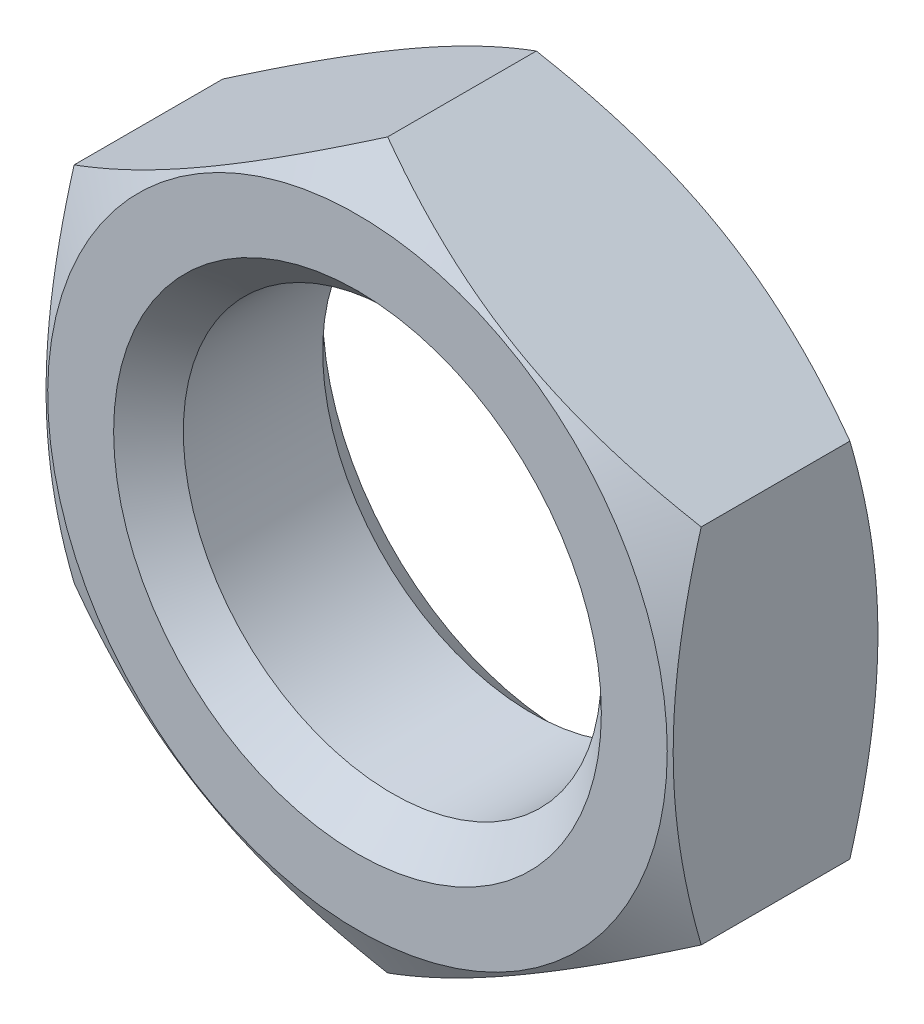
ISO-10303-21;
HEADER;
FILE_DESCRIPTION(('STEP AP214'),'2;1');
FILE_NAME('part.step','',(''),(''),'','','');
FILE_SCHEMA(('AUTOMOTIVE_DESIGN { 1 0 10303 214 1 1 1 1 }'));
ENDSEC;
DATA;
#1=APPLICATION_CONTEXT('core data for automotive mechanical design processes');
#2=APPLICATION_PROTOCOL_DEFINITION('international standard','automotive_design',2000,#1);
#3=PRODUCT_CONTEXT('',#1,'mechanical');
#4=PRODUCT('Part','Part','',(#3));
#5=PRODUCT_RELATED_PRODUCT_CATEGORY('part','',(#4));
#6=PRODUCT_DEFINITION_FORMATION('','',#4);
#7=PRODUCT_DEFINITION_CONTEXT('part definition',#1,'design');
#8=PRODUCT_DEFINITION('design','',#6,#7);
#9=PRODUCT_DEFINITION_SHAPE('','',#8);
#10=(LENGTH_UNIT() NAMED_UNIT(*) SI_UNIT(.MILLI.,.METRE.));
#11=(NAMED_UNIT(*) PLANE_ANGLE_UNIT() SI_UNIT($,.RADIAN.));
#12=(NAMED_UNIT(*) SI_UNIT($,.STERADIAN.) SOLID_ANGLE_UNIT());
#13=UNCERTAINTY_MEASURE_WITH_UNIT(LENGTH_MEASURE(1.E-05),#10,'distance_accuracy_value','');
#14=(GEOMETRIC_REPRESENTATION_CONTEXT(3) GLOBAL_UNCERTAINTY_ASSIGNED_CONTEXT((#13)) GLOBAL_UNIT_ASSIGNED_CONTEXT((#10,
#11,#12)) REPRESENTATION_CONTEXT('',''));
#15=CARTESIAN_POINT('',(0.,0.,0.));
#16=DIRECTION('',(0.,0.,1.));
#17=DIRECTION('',(1.,0.,0.));
#18=AXIS2_PLACEMENT_3D('',#15,#16,#17);
#19=CARTESIAN_POINT('',(13.5,7.79422863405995,4.5));
#20=DIRECTION('',(-0.5,-0.866025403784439,0.));
#21=DIRECTION('',(0.866025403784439,-0.5,0.));
#22=AXIS2_PLACEMENT_3D('',#19,#20,#21);
#23=PLANE('',#22);
#24=CARTESIAN_POINT('',(-0.000200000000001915,15.5885727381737,-3.20089522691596));
#25=CARTESIAN_POINT('',(0.296524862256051,15.417258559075,-3.29979725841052));
#26=CARTESIAN_POINT('',(0.59440711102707,15.2452761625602,-3.39421132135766));
#27=CARTESIAN_POINT('',(1.19256027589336,14.899932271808,-3.57281600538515));
#28=CARTESIAN_POINT('',(1.49283194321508,14.7265703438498,-3.65700326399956));
#29=CARTESIAN_POINT('',(2.09634426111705,14.3781323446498,-3.81402269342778));
#30=CARTESIAN_POINT('',(2.39959019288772,14.2030532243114,-3.88682799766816));
#31=CARTESIAN_POINT('',(3.00818925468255,13.8516783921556,-4.01952017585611));
#32=CARTESIAN_POINT('',(3.31354226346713,13.6753827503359,-4.07940778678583));
#33=CARTESIAN_POINT('',(3.91853115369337,13.3260922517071,-4.18371734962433));
#34=CARTESIAN_POINT('',(4.21812211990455,13.1531233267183,-4.22848454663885));
#35=CARTESIAN_POINT('',(4.81867684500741,12.8063928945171,-4.30354932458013));
#36=CARTESIAN_POINT('',(5.11964063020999,12.632631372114,-4.33384662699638));
#37=CARTESIAN_POINT('',(5.72207378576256,12.284816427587,-4.37920662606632));
#38=CARTESIAN_POINT('',(6.02354212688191,12.1107635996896,-4.3942874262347));
#39=CARTESIAN_POINT('',(6.62675710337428,11.7624972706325,-4.40889009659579));
#40=CARTESIAN_POINT('',(6.92850372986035,11.5882837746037,-4.40841244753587));
#41=CARTESIAN_POINT('',(7.49261810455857,11.2625921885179,-4.39298492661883));
#42=CARTESIAN_POINT('',(7.75502605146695,11.1110908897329,-4.37991684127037));
#43=CARTESIAN_POINT('',(8.27923834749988,10.8084367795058,-4.3422606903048));
#44=CARTESIAN_POINT('',(8.54104265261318,10.6572839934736,-4.31767180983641));
#45=CARTESIAN_POINT('',(9.06390546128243,10.3554090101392,-4.25740279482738));
#46=CARTESIAN_POINT('',(9.32496316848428,10.2046872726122,-4.22171349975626));
#47=CARTESIAN_POINT('',(9.84585469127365,9.90395041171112,-4.13986982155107));
#48=CARTESIAN_POINT('',(10.1056884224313,9.7539353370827,-4.09371472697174));
#49=CARTESIAN_POINT('',(10.8944281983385,9.29855621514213,-3.93838400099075));
#50=CARTESIAN_POINT('',(11.4210501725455,8.99451087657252,-3.81372022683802));
#51=CARTESIAN_POINT('',(12.4664415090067,8.39095390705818,-3.53078439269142));
#52=CARTESIAN_POINT('',(12.9852242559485,8.09143454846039,-3.37257878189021));
#53=CARTESIAN_POINT('',(13.5002,7.79411316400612,-3.20089522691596));
#54=B_SPLINE_CURVE_WITH_KNOTS('',3,(#24,#25,#26,#27,#28,#29,#30,#31,#32,#33,#34,#35,#36,#37,#38,
#39,#40,#41,#42,#43,#44,#45,#46,#47,#48,#49,#50,#51,#52,#53),.UNSPECIFIED.,.F.,.F.,(4,2,2,2,2,2,
2,2,2,2,2,2,2,2,4),(0.,1.0698794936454,2.14010980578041,3.21282939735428,4.28548777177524,
5.33167033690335,6.3778730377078,7.42282956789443,8.46775380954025,9.37738732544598,
10.2870851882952,11.1975357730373,12.1080482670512,13.9691139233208,15.8265265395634),.UNSPECIFIED.);
#55=CARTESIAN_POINT('',(0.,15.5884572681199,-3.20096189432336));
#56=VERTEX_POINT('',#55);
#57=CARTESIAN_POINT('',(13.5,7.79422863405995,-3.20096189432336));
#58=VERTEX_POINT('',#57);
#59=EDGE_CURVE('E55',#56,#58,#54,.T.);
#60=ORIENTED_EDGE('',*,*,#59,.F.);
#61=DIRECTION('',(0.,0.,-1.));
#62=VECTOR('',#61,1.);
#63=CARTESIAN_POINT('',(0.,15.5884572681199,4.5));
#64=LINE('',#63,#62);
#65=CARTESIAN_POINT('',(0.,15.5884572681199,3.20096189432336));
#66=VERTEX_POINT('',#65);
#67=EDGE_CURVE('E105',#66,#56,#64,.T.);
#68=ORIENTED_EDGE('',*,*,#67,.F.);
#69=CARTESIAN_POINT('',(13.5002,7.79411316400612,3.20089522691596));
#70=CARTESIAN_POINT('',(13.2034751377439,7.9654273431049,3.29979725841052));
#71=CARTESIAN_POINT('',(12.9055928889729,8.13740973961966,3.39421132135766));
#72=CARTESIAN_POINT('',(12.3074397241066,8.48275363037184,3.57281600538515));
#73=CARTESIAN_POINT('',(12.0071680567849,8.65611555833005,3.65700326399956));
#74=CARTESIAN_POINT('',(11.403655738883,9.00455355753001,3.81402269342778));
#75=CARTESIAN_POINT('',(11.1004098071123,9.17963267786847,3.88682799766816));
#76=CARTESIAN_POINT('',(10.4918107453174,9.53100751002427,4.01952017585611));
#77=CARTESIAN_POINT('',(10.1864577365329,9.70730315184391,4.07940778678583));
#78=CARTESIAN_POINT('',(9.58146884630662,10.0565936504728,4.18371734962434));
#79=CARTESIAN_POINT('',(9.28187788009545,10.2295625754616,4.22848454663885));
#80=CARTESIAN_POINT('',(8.68132315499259,10.5762930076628,4.30354932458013));
#81=CARTESIAN_POINT('',(8.38035936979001,10.7500545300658,4.33384662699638));
#82=CARTESIAN_POINT('',(7.77792621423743,11.0978694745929,4.37920662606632));
#83=CARTESIAN_POINT('',(7.47645787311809,11.2719223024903,4.3942874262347));
#84=CARTESIAN_POINT('',(6.87324289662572,11.6201886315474,4.4088900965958));
#85=CARTESIAN_POINT('',(6.57149627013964,11.7944021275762,4.40841244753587));
#86=CARTESIAN_POINT('',(6.00738189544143,12.1200937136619,4.39298492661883));
#87=CARTESIAN_POINT('',(5.74497394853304,12.271595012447,4.37991684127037));
#88=CARTESIAN_POINT('',(5.22076165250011,12.5742491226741,4.3422606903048));
#89=CARTESIAN_POINT('',(4.95895734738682,12.7254019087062,4.31767180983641));
#90=CARTESIAN_POINT('',(4.43609453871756,13.0272768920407,4.25740279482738));
#91=CARTESIAN_POINT('',(4.17503683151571,13.1779986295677,4.22171349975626));
#92=CARTESIAN_POINT('',(3.65414530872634,13.4787354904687,4.13986982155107));
#93=CARTESIAN_POINT('',(3.39431157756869,13.6287505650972,4.09371472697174));
#94=CARTESIAN_POINT('',(2.60557180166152,14.0841296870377,3.93838400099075));
#95=CARTESIAN_POINT('',(2.07894982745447,14.3881750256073,3.81372022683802));
#96=CARTESIAN_POINT('',(1.03355849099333,14.9917319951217,3.53078439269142));
#97=CARTESIAN_POINT('',(0.514775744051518,15.2912513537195,3.37257878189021));
#98=CARTESIAN_POINT('',(-0.000200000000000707,15.5885727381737,3.20089522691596));
#99=B_SPLINE_CURVE_WITH_KNOTS('',3,(#69,#70,#71,#72,#73,#74,#75,#76,#77,#78,#79,#80,#81,#82,#83,
#84,#85,#86,#87,#88,#89,#90,#91,#92,#93,#94,#95,#96,#97,#98),.UNSPECIFIED.,.F.,.F.,(4,2,2,2,2,2,
2,2,2,2,2,2,2,2,4),(0.,1.0698794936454,2.14010980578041,3.21282939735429,4.28548777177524,
5.33167033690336,6.37787303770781,7.42282956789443,8.46775380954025,9.37738732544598,
10.2870851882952,11.1975357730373,12.1080482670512,13.9691139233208,15.8265265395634),.UNSPECIFIED.);
#100=CARTESIAN_POINT('',(13.5,7.79422863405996,3.20096189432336));
#101=VERTEX_POINT('',#100);
#102=EDGE_CURVE('E219',#101,#66,#99,.T.);
#103=ORIENTED_EDGE('',*,*,#102,.F.);
#104=DIRECTION('',(0.,0.,-1.));
#105=VECTOR('',#104,1.);
#106=CARTESIAN_POINT('',(13.5,7.79422863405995,4.5));
#107=LINE('',#106,#105);
#108=EDGE_CURVE('E107',#101,#58,#107,.T.);
#109=ORIENTED_EDGE('',*,*,#108,.T.);
#110=EDGE_LOOP('',(#60,#68,#103,#109));
#111=FACE_BOUND('',#110,.T.);
#112=ADVANCED_FACE('F39',(#111),#23,.F.);
#113=CARTESIAN_POINT('',(0.,15.5884572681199,4.5));
#114=DIRECTION('',(0.5,-0.866025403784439,0.));
#115=DIRECTION('',(0.866025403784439,0.5,0.));
#116=AXIS2_PLACEMENT_3D('',#113,#114,#115);
#117=PLANE('',#116);
#118=CARTESIAN_POINT('',(-13.5002,7.79411316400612,-3.20089522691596));
#119=CARTESIAN_POINT('',(-13.2034751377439,7.96542734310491,-3.29979725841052));
#120=CARTESIAN_POINT('',(-12.9055928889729,8.13740973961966,-3.39421132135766));
#121=CARTESIAN_POINT('',(-12.3074397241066,8.48275363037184,-3.57281600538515));
#122=CARTESIAN_POINT('',(-12.0071680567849,8.65611555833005,-3.65700326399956));
#123=CARTESIAN_POINT('',(-11.403655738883,9.00455355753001,-3.81402269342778));
#124=CARTESIAN_POINT('',(-11.1004098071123,9.17963267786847,-3.88682799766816));
#125=CARTESIAN_POINT('',(-10.4918107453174,9.53100751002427,-4.01952017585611));
#126=CARTESIAN_POINT('',(-10.1864577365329,9.70730315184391,-4.07940778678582));
#127=CARTESIAN_POINT('',(-9.58146884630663,10.0565936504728,-4.18371734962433));
#128=CARTESIAN_POINT('',(-9.28187788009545,10.2295625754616,-4.22848454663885));
#129=CARTESIAN_POINT('',(-8.68132315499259,10.5762930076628,-4.30354932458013));
#130=CARTESIAN_POINT('',(-8.38035936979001,10.7500545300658,-4.33384662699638));
#131=CARTESIAN_POINT('',(-7.77792621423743,11.0978694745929,-4.37920662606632));
#132=CARTESIAN_POINT('',(-7.47645787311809,11.2719223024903,-4.3942874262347));
#133=CARTESIAN_POINT('',(-6.87324289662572,11.6201886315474,-4.40889009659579));
#134=CARTESIAN_POINT('',(-6.57149627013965,11.7944021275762,-4.40841244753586));
#135=CARTESIAN_POINT('',(-6.00738189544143,12.1200937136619,-4.39298492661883));
#136=CARTESIAN_POINT('',(-5.74497394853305,12.271595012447,-4.37991684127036));
#137=CARTESIAN_POINT('',(-5.22076165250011,12.5742491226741,-4.3422606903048));
#138=CARTESIAN_POINT('',(-4.95895734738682,12.7254019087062,-4.31767180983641));
#139=CARTESIAN_POINT('',(-4.43609453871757,13.0272768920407,-4.25740279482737));
#140=CARTESIAN_POINT('',(-4.17503683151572,13.1779986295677,-4.22171349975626));
#141=CARTESIAN_POINT('',(-3.65414530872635,13.4787354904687,-4.13986982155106));
#142=CARTESIAN_POINT('',(-3.39431157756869,13.6287505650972,-4.09371472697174));
#143=CARTESIAN_POINT('',(-2.60557180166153,14.0841296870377,-3.93838400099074));
#144=CARTESIAN_POINT('',(-2.07894982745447,14.3881750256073,-3.81372022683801));
#145=CARTESIAN_POINT('',(-1.03355849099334,14.9917319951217,-3.53078439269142));
#146=CARTESIAN_POINT('',(-0.514775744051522,15.2912513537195,-3.37257878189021));
#147=CARTESIAN_POINT('',(0.000199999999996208,15.5885727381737,-3.20089522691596));
#148=B_SPLINE_CURVE_WITH_KNOTS('',3,(#118,#119,#120,#121,#122,#123,#124,#125,#126,#127,#128,
#129,#130,#131,#132,#133,#134,#135,#136,#137,#138,#139,#140,#141,#142,#143,#144,#145,#146,#147),
.UNSPECIFIED.,.F.,.F.,(4,2,2,2,2,2,2,2,2,2,2,2,2,2,4),(0.,1.0698794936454,2.14010980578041,
3.21282939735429,4.28548777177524,5.33167033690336,6.37787303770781,7.42282956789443,
8.46775380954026,9.37738732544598,10.2870851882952,11.1975357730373,12.1080482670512,
13.9691139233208,15.8265265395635),.UNSPECIFIED.);
#149=CARTESIAN_POINT('',(-13.5,7.79422863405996,-3.20096189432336));
#150=VERTEX_POINT('',#149);
#151=EDGE_CURVE('E91',#150,#56,#148,.T.);
#152=ORIENTED_EDGE('',*,*,#151,.F.);
#153=DIRECTION('',(0.,0.,-1.));
#154=VECTOR('',#153,1.);
#155=CARTESIAN_POINT('',(-13.5,7.79422863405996,4.5));
#156=LINE('',#155,#154);
#157=CARTESIAN_POINT('',(-13.5,7.79422863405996,3.20096189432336));
#158=VERTEX_POINT('',#157);
#159=EDGE_CURVE('E116',#158,#150,#156,.T.);
#160=ORIENTED_EDGE('',*,*,#159,.F.);
#161=CARTESIAN_POINT('',(0.000199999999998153,15.5885727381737,3.20089522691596));
#162=CARTESIAN_POINT('',(-0.296524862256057,15.417258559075,3.29979725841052));
#163=CARTESIAN_POINT('',(-0.594407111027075,15.2452761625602,3.39421132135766));
#164=CARTESIAN_POINT('',(-1.19256027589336,14.899932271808,3.57281600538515));
#165=CARTESIAN_POINT('',(-1.49283194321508,14.7265703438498,3.65700326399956));
#166=CARTESIAN_POINT('',(-2.09634426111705,14.3781323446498,3.81402269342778));
#167=CARTESIAN_POINT('',(-2.39959019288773,14.2030532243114,3.88682799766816));
#168=CARTESIAN_POINT('',(-3.00818925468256,13.8516783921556,4.01952017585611));
#169=CARTESIAN_POINT('',(-3.31354226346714,13.6753827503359,4.07940778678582));
#170=CARTESIAN_POINT('',(-3.91853115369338,13.3260922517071,4.18371734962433));
#171=CARTESIAN_POINT('',(-4.21812211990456,13.1531233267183,4.22848454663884));
#172=CARTESIAN_POINT('',(-4.81867684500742,12.8063928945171,4.30354932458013));
#173=CARTESIAN_POINT('',(-5.11964063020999,12.632631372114,4.33384662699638));
#174=CARTESIAN_POINT('',(-5.72207378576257,12.284816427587,4.37920662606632));
#175=CARTESIAN_POINT('',(-6.02354212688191,12.1107635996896,4.3942874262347));
#176=CARTESIAN_POINT('',(-6.62675710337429,11.7624972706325,4.40889009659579));
#177=CARTESIAN_POINT('',(-6.92850372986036,11.5882837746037,4.40841244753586));
#178=CARTESIAN_POINT('',(-7.49261810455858,11.2625921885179,4.39298492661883));
#179=CARTESIAN_POINT('',(-7.75502605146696,11.1110908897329,4.37991684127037));
#180=CARTESIAN_POINT('',(-8.27923834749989,10.8084367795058,4.3422606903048));
#181=CARTESIAN_POINT('',(-8.54104265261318,10.6572839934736,4.31767180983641));
#182=CARTESIAN_POINT('',(-9.06390546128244,10.3554090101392,4.25740279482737));
#183=CARTESIAN_POINT('',(-9.32496316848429,10.2046872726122,4.22171349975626));
#184=CARTESIAN_POINT('',(-9.84585469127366,9.90395041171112,4.13986982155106));
#185=CARTESIAN_POINT('',(-10.1056884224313,9.7539353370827,4.09371472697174));
#186=CARTESIAN_POINT('',(-10.8944281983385,9.29855621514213,3.93838400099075));
#187=CARTESIAN_POINT('',(-11.4210501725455,8.99451087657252,3.81372022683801));
#188=CARTESIAN_POINT('',(-12.4664415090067,8.39095390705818,3.53078439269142));
#189=CARTESIAN_POINT('',(-12.9852242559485,8.09143454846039,3.37257878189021));
#190=CARTESIAN_POINT('',(-13.5002,7.79411316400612,3.20089522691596));
#191=B_SPLINE_CURVE_WITH_KNOTS('',3,(#161,#162,#163,#164,#165,#166,#167,#168,#169,#170,#171,
#172,#173,#174,#175,#176,#177,#178,#179,#180,#181,#182,#183,#184,#185,#186,#187,#188,#189,#190),
.UNSPECIFIED.,.F.,.F.,(4,2,2,2,2,2,2,2,2,2,2,2,2,2,4),(0.,1.0698794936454,2.14010980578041,
3.21282939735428,4.28548777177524,5.33167033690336,6.37787303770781,7.42282956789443,
8.46775380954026,9.37738732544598,10.2870851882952,11.1975357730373,12.1080482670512,
13.9691139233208,15.8265265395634),.UNSPECIFIED.);
#192=EDGE_CURVE('E113',#66,#158,#191,.T.);
#193=ORIENTED_EDGE('',*,*,#192,.F.);
#194=ORIENTED_EDGE('',*,*,#67,.T.);
#195=EDGE_LOOP('',(#152,#160,#193,#194));
#196=FACE_BOUND('',#195,.T.);
#197=ADVANCED_FACE('F112',(#196),#117,.F.);
#198=CARTESIAN_POINT('',(-13.5,7.79422863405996,4.5));
#199=DIRECTION('',(1.,0.,0.));
#200=DIRECTION('',(0.,0.,-1.));
#201=AXIS2_PLACEMENT_3D('',#198,#199,#200);
#202=PLANE('',#201);
#203=CARTESIAN_POINT('',(-13.5,-20.6585095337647,2.04712588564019));
#204=CARTESIAN_POINT('',(-13.5,-20.3622076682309,1.90392477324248));
#205=CARTESIAN_POINT('',(-13.5,-20.065547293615,1.76146583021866));
#206=CARTESIAN_POINT('',(-13.5,-19.4714337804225,1.47820266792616));
#207=CARTESIAN_POINT('',(-13.5,-19.1739806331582,1.3373984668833));
#208=CARTESIAN_POINT('',(-13.5,-18.2802311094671,0.917682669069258));
#209=CARTESIAN_POINT('',(-13.5,-17.6826411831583,0.641514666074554));
#210=CARTESIAN_POINT('',(-13.5,-16.479901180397,0.0966974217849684));
#211=CARTESIAN_POINT('',(-13.5,-15.8747274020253,-0.171899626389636));
#212=CARTESIAN_POINT('',(-13.5,-14.6594016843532,-0.697542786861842));
#213=CARTESIAN_POINT('',(-13.5,-14.0492500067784,-0.954589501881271));
#214=CARTESIAN_POINT('',(-13.5,-12.8154840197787,-1.45707960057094));
#215=CARTESIAN_POINT('',(-13.5,-12.1917962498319,-1.70234356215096));
#216=CARTESIAN_POINT('',(-13.5,-10.9370553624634,-2.17363098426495));
#217=CARTESIAN_POINT('',(-13.5,-10.3060014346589,-2.39965230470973));
#218=CARTESIAN_POINT('',(-13.5,-9.03684552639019,-2.8263688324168));
#219=CARTESIAN_POINT('',(-13.5,-8.3987618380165,-3.027117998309));
#220=CARTESIAN_POINT('',(-13.5,-7.11346213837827,-3.39677204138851));
#221=CARTESIAN_POINT('',(-13.5,-6.46624908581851,-3.56568699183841));
#222=CARTESIAN_POINT('',(-13.5,-5.48845854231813,-3.78899459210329));
#223=CARTESIAN_POINT('',(-13.5,-5.16129424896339,-3.85843154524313));
#224=CARTESIAN_POINT('',(-13.5,-4.50479081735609,-3.9861856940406));
#225=CARTESIAN_POINT('',(-13.5,-4.17545172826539,-4.04450314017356));
#226=CARTESIAN_POINT('',(-13.5,-3.51481454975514,-4.14898462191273));
#227=CARTESIAN_POINT('',(-13.5,-3.18351630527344,-4.1951476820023));
#228=CARTESIAN_POINT('',(-13.5,-2.51935990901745,-4.27438983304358));
#229=CARTESIAN_POINT('',(-13.5,-2.18650181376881,-4.30746939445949));
#230=CARTESIAN_POINT('',(-13.5,-1.52179823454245,-4.3596576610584));
#231=CARTESIAN_POINT('',(-13.5,-1.18995961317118,-4.37885320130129));
#232=CARTESIAN_POINT('',(-13.5,-0.525768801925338,-4.40317169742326));
#233=CARTESIAN_POINT('',(-13.5,-0.193416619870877,-4.40829486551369));
#234=CARTESIAN_POINT('',(-13.5,0.471111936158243,-4.404347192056));
#235=CARTESIAN_POINT('',(-13.5,0.803288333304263,-4.39528032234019));
#236=CARTESIAN_POINT('',(-13.5,1.46696963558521,-4.363177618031));
#237=CARTESIAN_POINT('',(-13.5,1.79847450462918,-4.34014105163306));
#238=CARTESIAN_POINT('',(-13.5,2.60211133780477,-4.2678422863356));
#239=CARTESIAN_POINT('',(-13.5,3.07362506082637,-4.21157181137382));
#240=CARTESIAN_POINT('',(-13.5,4.01295003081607,-4.07390544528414));
#241=CARTESIAN_POINT('',(-13.5,4.48076071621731,-3.99250581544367));
#242=CARTESIAN_POINT('',(-13.5,5.87945861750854,-3.71469698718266));
#243=CARTESIAN_POINT('',(-13.5,6.803783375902,-3.48486325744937));
#244=CARTESIAN_POINT('',(-13.5,8.18639357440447,-3.0886639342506));
#245=CARTESIAN_POINT('',(-13.5,8.65190554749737,-2.94608827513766));
#246=CARTESIAN_POINT('',(-13.5,9.57843212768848,-2.64674895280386));
#247=CARTESIAN_POINT('',(-13.5,10.0394463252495,-2.48998401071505));
#248=CARTESIAN_POINT('',(-13.5,10.9546789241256,-2.16560432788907));
#249=CARTESIAN_POINT('',(-13.5,11.4089209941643,-1.99805580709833));
#250=CARTESIAN_POINT('',(-13.5,12.0874247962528,-1.739492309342));
#251=CARTESIAN_POINT('',(-13.5,12.3130797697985,-1.65211246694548));
#252=CARTESIAN_POINT('',(-13.5,12.7635136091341,-1.47513517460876));
#253=CARTESIAN_POINT('',(-13.5,12.9882924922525,-1.38553776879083));
#254=CARTESIAN_POINT('',(-13.5,13.2126637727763,-1.29493169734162));
#255=B_SPLINE_CURVE_WITH_KNOTS('',3,(#203,#204,#205,#206,#207,#208,#209,#210,#211,#212,#213,
#214,#215,#216,#217,#218,#219,#220,#221,#222,#223,#224,#225,#226,#227,#228,#229,#230,#231,#232,
#233,#234,#235,#236,#237,#238,#239,#240,#241,#242,#243,#244,#245,#246,#247,#248,#249,#250,#251,
#252,#253,#254),.UNSPECIFIED.,.F.,.F.,(4,2,2,2,2,2,2,2,2,2,2,2,2,2,2,2,2,2,2,2,2,2,2,2,2,4),(0.,
0.987273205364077,1.97455727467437,3.94944721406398,5.93566126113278,7.92177154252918,
9.93206820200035,11.9425881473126,13.9487398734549,15.9542557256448,16.9574523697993,
17.9606264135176,18.9638809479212,19.9670994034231,20.9639878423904,21.9608612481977,
22.9574556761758,23.9541023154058,25.3778717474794,26.8018531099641,29.6553043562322,
31.1157595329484,32.5763464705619,34.0286910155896,34.7546275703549,35.4805496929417),.UNSPECIFIED.);
#256=CARTESIAN_POINT('',(-13.5,-7.79422863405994,-3.20096189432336));
#257=VERTEX_POINT('',#256);
#258=EDGE_CURVE('E94',#257,#150,#255,.T.);
#259=ORIENTED_EDGE('',*,*,#258,.F.);
#260=DIRECTION('',(0.,0.,-1.));
#261=VECTOR('',#260,1.);
#262=CARTESIAN_POINT('',(-13.5,-7.79422863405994,4.5));
#263=LINE('',#262,#261);
#264=CARTESIAN_POINT('',(-13.5,-7.79422863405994,3.20096189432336));
#265=VERTEX_POINT('',#264);
#266=EDGE_CURVE('E123',#265,#257,#263,.T.);
#267=ORIENTED_EDGE('',*,*,#266,.F.);
#268=CARTESIAN_POINT('',(-13.5,-20.6585095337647,-2.04712588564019));
#269=CARTESIAN_POINT('',(-13.5,-20.3622076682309,-1.90392477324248));
#270=CARTESIAN_POINT('',(-13.5,-20.065547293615,-1.76146583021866));
#271=CARTESIAN_POINT('',(-13.5,-19.4714337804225,-1.47820266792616));
#272=CARTESIAN_POINT('',(-13.5,-19.1739806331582,-1.3373984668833));
#273=CARTESIAN_POINT('',(-13.5,-18.2802311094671,-0.917682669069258));
#274=CARTESIAN_POINT('',(-13.5,-17.6826411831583,-0.641514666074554));
#275=CARTESIAN_POINT('',(-13.5,-16.479901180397,-0.0966974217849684));
#276=CARTESIAN_POINT('',(-13.5,-15.8747274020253,0.171899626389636));
#277=CARTESIAN_POINT('',(-13.5,-14.6594016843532,0.697542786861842));
#278=CARTESIAN_POINT('',(-13.5,-14.0492500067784,0.954589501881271));
#279=CARTESIAN_POINT('',(-13.5,-12.8154840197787,1.45707960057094));
#280=CARTESIAN_POINT('',(-13.5,-12.1917962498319,1.70234356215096));
#281=CARTESIAN_POINT('',(-13.5,-10.9370553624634,2.17363098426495));
#282=CARTESIAN_POINT('',(-13.5,-10.3060014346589,2.39965230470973));
#283=CARTESIAN_POINT('',(-13.5,-9.03684552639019,2.8263688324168));
#284=CARTESIAN_POINT('',(-13.5,-8.3987618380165,3.027117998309));
#285=CARTESIAN_POINT('',(-13.5,-7.11346213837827,3.39677204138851));
#286=CARTESIAN_POINT('',(-13.5,-6.46624908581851,3.56568699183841));
#287=CARTESIAN_POINT('',(-13.5,-5.48845854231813,3.78899459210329));
#288=CARTESIAN_POINT('',(-13.5,-5.16129424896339,3.85843154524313));
#289=CARTESIAN_POINT('',(-13.5,-4.50479081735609,3.9861856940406));
#290=CARTESIAN_POINT('',(-13.5,-4.17545172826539,4.04450314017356));
#291=CARTESIAN_POINT('',(-13.5,-3.51481454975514,4.14898462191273));
#292=CARTESIAN_POINT('',(-13.5,-3.18351630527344,4.1951476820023));
#293=CARTESIAN_POINT('',(-13.5,-2.51935990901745,4.27438983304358));
#294=CARTESIAN_POINT('',(-13.5,-2.18650181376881,4.30746939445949));
#295=CARTESIAN_POINT('',(-13.5,-1.52179823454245,4.3596576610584));
#296=CARTESIAN_POINT('',(-13.5,-1.18995961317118,4.37885320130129));
#297=CARTESIAN_POINT('',(-13.5,-0.525768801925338,4.40317169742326));
#298=CARTESIAN_POINT('',(-13.5,-0.193416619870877,4.40829486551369));
#299=CARTESIAN_POINT('',(-13.5,0.471111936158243,4.404347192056));
#300=CARTESIAN_POINT('',(-13.5,0.803288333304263,4.39528032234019));
#301=CARTESIAN_POINT('',(-13.5,1.46696963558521,4.363177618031));
#302=CARTESIAN_POINT('',(-13.5,1.79847450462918,4.34014105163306));
#303=CARTESIAN_POINT('',(-13.5,2.60211133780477,4.2678422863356));
#304=CARTESIAN_POINT('',(-13.5,3.07362506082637,4.21157181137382));
#305=CARTESIAN_POINT('',(-13.5,4.01295003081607,4.07390544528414));
#306=CARTESIAN_POINT('',(-13.5,4.48076071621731,3.99250581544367));
#307=CARTESIAN_POINT('',(-13.5,5.87945861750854,3.71469698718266));
#308=CARTESIAN_POINT('',(-13.5,6.803783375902,3.48486325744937));
#309=CARTESIAN_POINT('',(-13.5,8.18639357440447,3.0886639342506));
#310=CARTESIAN_POINT('',(-13.5,8.65190554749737,2.94608827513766));
#311=CARTESIAN_POINT('',(-13.5,9.57843212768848,2.64674895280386));
#312=CARTESIAN_POINT('',(-13.5,10.0394463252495,2.48998401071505));
#313=CARTESIAN_POINT('',(-13.5,10.9546789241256,2.16560432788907));
#314=CARTESIAN_POINT('',(-13.5,11.4089209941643,1.99805580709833));
#315=CARTESIAN_POINT('',(-13.5,12.0874247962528,1.739492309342));
#316=CARTESIAN_POINT('',(-13.5,12.3130797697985,1.65211246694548));
#317=CARTESIAN_POINT('',(-13.5,12.7635136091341,1.47513517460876));
#318=CARTESIAN_POINT('',(-13.5,12.9882924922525,1.38553776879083));
#319=CARTESIAN_POINT('',(-13.5,13.2126637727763,1.29493169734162));
#320=B_SPLINE_CURVE_WITH_KNOTS('',3,(#268,#269,#270,#271,#272,#273,#274,#275,#276,#277,#278,
#279,#280,#281,#282,#283,#284,#285,#286,#287,#288,#289,#290,#291,#292,#293,#294,#295,#296,#297,
#298,#299,#300,#301,#302,#303,#304,#305,#306,#307,#308,#309,#310,#311,#312,#313,#314,#315,#316,
#317,#318,#319),.UNSPECIFIED.,.F.,.F.,(4,2,2,2,2,2,2,2,2,2,2,2,2,2,2,2,2,2,2,2,2,2,2,2,2,4),(0.,
0.987273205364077,1.97455727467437,3.94944721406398,5.93566126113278,7.92177154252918,
9.93206820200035,11.9425881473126,13.9487398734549,15.9542557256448,16.9574523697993,
17.9606264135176,18.9638809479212,19.9670994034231,20.9639878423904,21.9608612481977,
22.9574556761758,23.9541023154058,25.3778717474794,26.8018531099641,29.6553043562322,
31.1157595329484,32.5763464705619,34.0286910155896,34.7546275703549,35.4805496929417),.UNSPECIFIED.);
#321=EDGE_CURVE('E208',#158,#265,#320,.F.);
#322=ORIENTED_EDGE('',*,*,#321,.F.);
#323=ORIENTED_EDGE('',*,*,#159,.T.);
#324=EDGE_LOOP('',(#259,#267,#322,#323));
#325=FACE_BOUND('',#324,.T.);
#326=ADVANCED_FACE('F227',(#325),#202,.F.);
#327=CARTESIAN_POINT('',(-13.5,-7.79422863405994,4.5));
#328=DIRECTION('',(0.5,0.866025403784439,0.));
#329=DIRECTION('',(-0.866025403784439,0.5,0.));
#330=AXIS2_PLACEMENT_3D('',#327,#328,#329);
#331=PLANE('',#330);
#332=CARTESIAN_POINT('',(0.000199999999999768,-15.5885727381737,-3.20089522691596));
#333=CARTESIAN_POINT('',(-0.296524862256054,-15.4172585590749,-3.29979725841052));
#334=CARTESIAN_POINT('',(-0.594407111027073,-15.2452761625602,-3.39421132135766));
#335=CARTESIAN_POINT('',(-1.19256027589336,-14.899932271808,-3.57281600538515));
#336=CARTESIAN_POINT('',(-1.49283194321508,-14.7265703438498,-3.65700326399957));
#337=CARTESIAN_POINT('',(-2.09634426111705,-14.3781323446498,-3.81402269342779));
#338=CARTESIAN_POINT('',(-2.39959019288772,-14.2030532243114,-3.88682799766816));
#339=CARTESIAN_POINT('',(-3.00818925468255,-13.8516783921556,-4.01952017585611));
#340=CARTESIAN_POINT('',(-3.31354226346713,-13.6753827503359,-4.07940778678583));
#341=CARTESIAN_POINT('',(-3.91853115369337,-13.3260922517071,-4.18371734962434));
#342=CARTESIAN_POINT('',(-4.21812211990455,-13.1531233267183,-4.22848454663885));
#343=CARTESIAN_POINT('',(-4.81867684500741,-12.8063928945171,-4.30354932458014));
#344=CARTESIAN_POINT('',(-5.11964063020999,-12.632631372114,-4.33384662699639));
#345=CARTESIAN_POINT('',(-5.72207378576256,-12.284816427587,-4.37920662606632));
#346=CARTESIAN_POINT('',(-6.0235421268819,-12.1107635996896,-4.39428742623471));
#347=CARTESIAN_POINT('',(-6.62675710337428,-11.7624972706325,-4.4088900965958));
#348=CARTESIAN_POINT('',(-6.92850372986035,-11.5882837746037,-4.40841244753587));
#349=CARTESIAN_POINT('',(-7.49261810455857,-11.2625921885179,-4.39298492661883));
#350=CARTESIAN_POINT('',(-7.75502605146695,-11.1110908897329,-4.37991684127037));
#351=CARTESIAN_POINT('',(-8.27923834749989,-10.8084367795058,-4.3422606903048));
#352=CARTESIAN_POINT('',(-8.54104265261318,-10.6572839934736,-4.31767180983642));
#353=CARTESIAN_POINT('',(-9.06390546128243,-10.3554090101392,-4.25740279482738));
#354=CARTESIAN_POINT('',(-9.32496316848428,-10.2046872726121,-4.22171349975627));
#355=CARTESIAN_POINT('',(-9.84585469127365,-9.90395041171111,-4.13986982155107));
#356=CARTESIAN_POINT('',(-10.1056884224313,-9.75393533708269,-4.09371472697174));
#357=CARTESIAN_POINT('',(-10.8944281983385,-9.29855621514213,-3.93838400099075));
#358=CARTESIAN_POINT('',(-11.4210501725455,-8.99451087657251,-3.81372022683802));
#359=CARTESIAN_POINT('',(-12.4664415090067,-8.39095390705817,-3.53078439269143));
#360=CARTESIAN_POINT('',(-12.9852242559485,-8.09143454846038,-3.37257878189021));
#361=CARTESIAN_POINT('',(-13.5002,-7.79411316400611,-3.20089522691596));
#362=B_SPLINE_CURVE_WITH_KNOTS('',3,(#332,#333,#334,#335,#336,#337,#338,#339,#340,#341,#342,
#343,#344,#345,#346,#347,#348,#349,#350,#351,#352,#353,#354,#355,#356,#357,#358,#359,#360,#361),
.UNSPECIFIED.,.F.,.F.,(4,2,2,2,2,2,2,2,2,2,2,2,2,2,4),(0.,1.0698794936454,2.14010980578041,
3.21282939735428,4.28548777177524,5.33167033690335,6.3778730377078,7.42282956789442,
8.46775380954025,9.37738732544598,10.2870851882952,11.1975357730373,12.1080482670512,
13.9691139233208,15.8265265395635),.UNSPECIFIED.);
#363=CARTESIAN_POINT('',(0.,-15.5884572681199,-3.20096189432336));
#364=VERTEX_POINT('',#363);
#365=EDGE_CURVE('E241',#364,#257,#362,.T.);
#366=ORIENTED_EDGE('',*,*,#365,.F.);
#367=DIRECTION('',(0.,0.,-1.));
#368=VECTOR('',#367,1.);
#369=CARTESIAN_POINT('',(0.,-15.5884572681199,4.5));
#370=LINE('',#369,#368);
#371=CARTESIAN_POINT('',(0.,-15.5884572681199,3.20096189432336));
#372=VERTEX_POINT('',#371);
#373=EDGE_CURVE('E370',#372,#364,#370,.T.);
#374=ORIENTED_EDGE('',*,*,#373,.F.);
#375=CARTESIAN_POINT('',(-13.5002,-7.79411316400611,3.20089522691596));
#376=CARTESIAN_POINT('',(-13.2034751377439,-7.96542734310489,3.29979725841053));
#377=CARTESIAN_POINT('',(-12.9055928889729,-8.13740973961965,3.39421132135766));
#378=CARTESIAN_POINT('',(-12.3074397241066,-8.48275363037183,3.57281600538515));
#379=CARTESIAN_POINT('',(-12.0071680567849,-8.65611555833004,3.65700326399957));
#380=CARTESIAN_POINT('',(-11.403655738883,-9.00455355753,3.81402269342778));
#381=CARTESIAN_POINT('',(-11.1004098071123,-9.17963267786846,3.88682799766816));
#382=CARTESIAN_POINT('',(-10.4918107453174,-9.53100751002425,4.01952017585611));
#383=CARTESIAN_POINT('',(-10.1864577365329,-9.70730315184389,4.07940778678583));
#384=CARTESIAN_POINT('',(-9.58146884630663,-10.0565936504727,4.18371734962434));
#385=CARTESIAN_POINT('',(-9.28187788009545,-10.2295625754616,4.22848454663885));
#386=CARTESIAN_POINT('',(-8.68132315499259,-10.5762930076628,4.30354932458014));
#387=CARTESIAN_POINT('',(-8.38035936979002,-10.7500545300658,4.33384662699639));
#388=CARTESIAN_POINT('',(-7.77792621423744,-11.0978694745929,4.37920662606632));
#389=CARTESIAN_POINT('',(-7.4764578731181,-11.2719223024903,4.39428742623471));
#390=CARTESIAN_POINT('',(-6.87324289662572,-11.6201886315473,4.4088900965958));
#391=CARTESIAN_POINT('',(-6.57149627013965,-11.7944021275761,4.40841244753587));
#392=CARTESIAN_POINT('',(-6.00738189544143,-12.1200937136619,4.39298492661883));
#393=CARTESIAN_POINT('',(-5.74497394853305,-12.2715950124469,4.37991684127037));
#394=CARTESIAN_POINT('',(-5.22076165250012,-12.5742491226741,4.3422606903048));
#395=CARTESIAN_POINT('',(-4.95895734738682,-12.7254019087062,4.31767180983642));
#396=CARTESIAN_POINT('',(-4.43609453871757,-13.0272768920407,4.25740279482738));
#397=CARTESIAN_POINT('',(-4.17503683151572,-13.1779986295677,4.22171349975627));
#398=CARTESIAN_POINT('',(-3.65414530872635,-13.4787354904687,4.13986982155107));
#399=CARTESIAN_POINT('',(-3.3943115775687,-13.6287505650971,4.09371472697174));
#400=CARTESIAN_POINT('',(-2.60557180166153,-14.0841296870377,3.93838400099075));
#401=CARTESIAN_POINT('',(-2.07894982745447,-14.3881750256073,3.81372022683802));
#402=CARTESIAN_POINT('',(-1.03355849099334,-14.9917319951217,3.53078439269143));
#403=CARTESIAN_POINT('',(-0.514775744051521,-15.2912513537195,3.37257878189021));
#404=CARTESIAN_POINT('',(0.000199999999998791,-15.5885727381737,3.20089522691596));
#405=B_SPLINE_CURVE_WITH_KNOTS('',3,(#375,#376,#377,#378,#379,#380,#381,#382,#383,#384,#385,
#386,#387,#388,#389,#390,#391,#392,#393,#394,#395,#396,#397,#398,#399,#400,#401,#402,#403,#404),
.UNSPECIFIED.,.F.,.F.,(4,2,2,2,2,2,2,2,2,2,2,2,2,2,4),(0.,1.0698794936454,2.1401098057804,
3.21282939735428,4.28548777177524,5.33167033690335,6.3778730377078,7.42282956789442,
8.46775380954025,9.37738732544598,10.2870851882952,11.1975357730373,12.1080482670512,
13.9691139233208,15.8265265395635),.UNSPECIFIED.);
#406=EDGE_CURVE('E203',#265,#372,#405,.T.);
#407=ORIENTED_EDGE('',*,*,#406,.F.);
#408=ORIENTED_EDGE('',*,*,#266,.T.);
#409=EDGE_LOOP('',(#366,#374,#407,#408));
#410=FACE_BOUND('',#409,.T.);
#411=ADVANCED_FACE('F246',(#410),#331,.F.);
#412=CARTESIAN_POINT('',(0.,-15.5884572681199,4.5));
#413=DIRECTION('',(-0.5,0.866025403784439,0.));
#414=DIRECTION('',(-0.866025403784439,-0.5,0.));
#415=AXIS2_PLACEMENT_3D('',#412,#413,#414);
#416=PLANE('',#415);
#417=CARTESIAN_POINT('',(13.5002,-7.79411316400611,-3.20089522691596));
#418=CARTESIAN_POINT('',(13.2034751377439,-7.9654273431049,-3.29979725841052));
#419=CARTESIAN_POINT('',(12.9055928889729,-8.13740973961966,-3.39421132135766));
#420=CARTESIAN_POINT('',(12.3074397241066,-8.48275363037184,-3.57281600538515));
#421=CARTESIAN_POINT('',(12.0071680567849,-8.65611555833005,-3.65700326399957));
#422=CARTESIAN_POINT('',(11.403655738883,-9.00455355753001,-3.81402269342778));
#423=CARTESIAN_POINT('',(11.1004098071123,-9.17963267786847,-3.88682799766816));
#424=CARTESIAN_POINT('',(10.4918107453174,-9.53100751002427,-4.01952017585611));
#425=CARTESIAN_POINT('',(10.1864577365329,-9.7073031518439,-4.07940778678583));
#426=CARTESIAN_POINT('',(9.58146884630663,-10.0565936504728,-4.18371734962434));
#427=CARTESIAN_POINT('',(9.28187788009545,-10.2295625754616,-4.22848454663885));
#428=CARTESIAN_POINT('',(8.68132315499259,-10.5762930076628,-4.30354932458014));
#429=CARTESIAN_POINT('',(8.38035936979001,-10.7500545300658,-4.33384662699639));
#430=CARTESIAN_POINT('',(7.77792621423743,-11.0978694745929,-4.37920662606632));
#431=CARTESIAN_POINT('',(7.47645787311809,-11.2719223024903,-4.3942874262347));
#432=CARTESIAN_POINT('',(6.87324289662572,-11.6201886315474,-4.4088900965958));
#433=CARTESIAN_POINT('',(6.57149627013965,-11.7944021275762,-4.40841244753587));
#434=CARTESIAN_POINT('',(6.00738189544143,-12.1200937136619,-4.39298492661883));
#435=CARTESIAN_POINT('',(5.74497394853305,-12.271595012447,-4.37991684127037));
#436=CARTESIAN_POINT('',(5.22076165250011,-12.5742491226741,-4.3422606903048));
#437=CARTESIAN_POINT('',(4.95895734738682,-12.7254019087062,-4.31767180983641));
#438=CARTESIAN_POINT('',(4.43609453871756,-13.0272768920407,-4.25740279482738));
#439=CARTESIAN_POINT('',(4.17503683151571,-13.1779986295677,-4.22171349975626));
#440=CARTESIAN_POINT('',(3.65414530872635,-13.4787354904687,-4.13986982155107));
#441=CARTESIAN_POINT('',(3.39431157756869,-13.6287505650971,-4.09371472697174));
#442=CARTESIAN_POINT('',(2.60557180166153,-14.0841296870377,-3.93838400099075));
#443=CARTESIAN_POINT('',(2.07894982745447,-14.3881750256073,-3.81372022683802));
#444=CARTESIAN_POINT('',(1.03355849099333,-14.9917319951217,-3.53078439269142));
#445=CARTESIAN_POINT('',(0.514775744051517,-15.2912513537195,-3.37257878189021));
#446=CARTESIAN_POINT('',(-0.000200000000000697,-15.5885727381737,-3.20089522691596));
#447=B_SPLINE_CURVE_WITH_KNOTS('',3,(#417,#418,#419,#420,#421,#422,#423,#424,#425,#426,#427,
#428,#429,#430,#431,#432,#433,#434,#435,#436,#437,#438,#439,#440,#441,#442,#443,#444,#445,#446),
.UNSPECIFIED.,.F.,.F.,(4,2,2,2,2,2,2,2,2,2,2,2,2,2,4),(0.,1.0698794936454,2.14010980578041,
3.21282939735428,4.28548777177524,5.33167033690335,6.3778730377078,7.42282956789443,
8.46775380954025,9.37738732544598,10.2870851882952,11.1975357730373,12.1080482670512,
13.9691139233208,15.8265265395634),.UNSPECIFIED.);
#448=CARTESIAN_POINT('',(13.5,-7.79422863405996,-3.20096189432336));
#449=VERTEX_POINT('',#448);
#450=EDGE_CURVE('E156',#449,#364,#447,.T.);
#451=ORIENTED_EDGE('',*,*,#450,.F.);
#452=DIRECTION('',(0.,0.,-1.));
#453=VECTOR('',#452,1.);
#454=CARTESIAN_POINT('',(13.5,-7.79422863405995,4.5));
#455=LINE('',#454,#453);
#456=CARTESIAN_POINT('',(13.5,-7.79422863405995,3.20096189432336));
#457=VERTEX_POINT('',#456);
#458=EDGE_CURVE('E367',#457,#449,#455,.T.);
#459=ORIENTED_EDGE('',*,*,#458,.F.);
#460=CARTESIAN_POINT('',(-0.000200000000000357,-15.5885727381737,3.20089522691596));
#461=CARTESIAN_POINT('',(0.296524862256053,-15.4172585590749,3.29979725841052));
#462=CARTESIAN_POINT('',(0.594407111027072,-15.2452761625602,3.39421132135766));
#463=CARTESIAN_POINT('',(1.19256027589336,-14.899932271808,3.57281600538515));
#464=CARTESIAN_POINT('',(1.49283194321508,-14.7265703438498,3.65700326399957));
#465=CARTESIAN_POINT('',(2.09634426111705,-14.3781323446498,3.81402269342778));
#466=CARTESIAN_POINT('',(2.39959019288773,-14.2030532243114,3.88682799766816));
#467=CARTESIAN_POINT('',(3.00818925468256,-13.8516783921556,4.01952017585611));
#468=CARTESIAN_POINT('',(3.31354226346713,-13.6753827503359,4.07940778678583));
#469=CARTESIAN_POINT('',(3.91853115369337,-13.3260922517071,4.18371734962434));
#470=CARTESIAN_POINT('',(4.21812211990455,-13.1531233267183,4.22848454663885));
#471=CARTESIAN_POINT('',(4.81867684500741,-12.8063928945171,4.30354932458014));
#472=CARTESIAN_POINT('',(5.11964063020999,-12.632631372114,4.33384662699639));
#473=CARTESIAN_POINT('',(5.72207378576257,-12.284816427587,4.37920662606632));
#474=CARTESIAN_POINT('',(6.02354212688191,-12.1107635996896,4.3942874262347));
#475=CARTESIAN_POINT('',(6.62675710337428,-11.7624972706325,4.4088900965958));
#476=CARTESIAN_POINT('',(6.92850372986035,-11.5882837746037,4.40841244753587));
#477=CARTESIAN_POINT('',(7.49261810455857,-11.2625921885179,4.39298492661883));
#478=CARTESIAN_POINT('',(7.75502605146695,-11.1110908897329,4.37991684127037));
#479=CARTESIAN_POINT('',(8.27923834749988,-10.8084367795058,4.3422606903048));
#480=CARTESIAN_POINT('',(8.54104265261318,-10.6572839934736,4.31767180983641));
#481=CARTESIAN_POINT('',(9.06390546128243,-10.3554090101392,4.25740279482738));
#482=CARTESIAN_POINT('',(9.32496316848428,-10.2046872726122,4.22171349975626));
#483=CARTESIAN_POINT('',(9.84585469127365,-9.90395041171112,4.13986982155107));
#484=CARTESIAN_POINT('',(10.1056884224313,-9.7539353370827,4.09371472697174));
#485=CARTESIAN_POINT('',(10.8944281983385,-9.29855621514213,3.93838400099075));
#486=CARTESIAN_POINT('',(11.4210501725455,-8.99451087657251,3.81372022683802));
#487=CARTESIAN_POINT('',(12.4664415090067,-8.39095390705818,3.53078439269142));
#488=CARTESIAN_POINT('',(12.9852242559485,-8.09143454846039,3.37257878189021));
#489=CARTESIAN_POINT('',(13.5002,-7.79411316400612,3.20089522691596));
#490=B_SPLINE_CURVE_WITH_KNOTS('',3,(#460,#461,#462,#463,#464,#465,#466,#467,#468,#469,#470,
#471,#472,#473,#474,#475,#476,#477,#478,#479,#480,#481,#482,#483,#484,#485,#486,#487,#488,#489),
.UNSPECIFIED.,.F.,.F.,(4,2,2,2,2,2,2,2,2,2,2,2,2,2,4),(0.,1.0698794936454,2.14010980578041,
3.21282939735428,4.28548777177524,5.33167033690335,6.3778730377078,7.42282956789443,
8.46775380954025,9.37738732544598,10.2870851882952,11.1975357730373,12.1080482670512,
13.9691139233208,15.8265265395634),.UNSPECIFIED.);
#491=EDGE_CURVE('E63',#372,#457,#490,.T.);
#492=ORIENTED_EDGE('',*,*,#491,.F.);
#493=ORIENTED_EDGE('',*,*,#373,.T.);
#494=EDGE_LOOP('',(#451,#459,#492,#493));
#495=FACE_BOUND('',#494,.T.);
#496=ADVANCED_FACE('F176',(#495),#416,.F.);
#497=CARTESIAN_POINT('',(13.5,-7.79422863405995,4.5));
#498=DIRECTION('',(-1.,0.,0.));
#499=DIRECTION('',(0.,0.,1.));
#500=AXIS2_PLACEMENT_3D('',#497,#498,#499);
#501=PLANE('',#500);
#502=CARTESIAN_POINT('',(13.5,-20.6585095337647,2.04712588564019));
#503=CARTESIAN_POINT('',(13.5,-20.3622076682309,1.90392477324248));
#504=CARTESIAN_POINT('',(13.5,-20.065547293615,1.76146583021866));
#505=CARTESIAN_POINT('',(13.5,-19.4714337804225,1.47820266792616));
#506=CARTESIAN_POINT('',(13.5,-19.1739806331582,1.3373984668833));
#507=CARTESIAN_POINT('',(13.5,-18.2802311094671,0.917682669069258));
#508=CARTESIAN_POINT('',(13.5,-17.6826411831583,0.641514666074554));
#509=CARTESIAN_POINT('',(13.5,-16.479901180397,0.0966974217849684));
#510=CARTESIAN_POINT('',(13.5,-15.8747274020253,-0.171899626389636));
#511=CARTESIAN_POINT('',(13.5,-14.6594016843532,-0.697542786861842));
#512=CARTESIAN_POINT('',(13.5,-14.0492500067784,-0.954589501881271));
#513=CARTESIAN_POINT('',(13.5,-12.8154840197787,-1.45707960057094));
#514=CARTESIAN_POINT('',(13.5,-12.1917962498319,-1.70234356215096));
#515=CARTESIAN_POINT('',(13.5,-10.9370553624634,-2.17363098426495));
#516=CARTESIAN_POINT('',(13.5,-10.3060014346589,-2.39965230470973));
#517=CARTESIAN_POINT('',(13.5,-9.0368455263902,-2.8263688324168));
#518=CARTESIAN_POINT('',(13.5,-8.39876183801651,-3.027117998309));
#519=CARTESIAN_POINT('',(13.5,-7.11346213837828,-3.39677204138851));
#520=CARTESIAN_POINT('',(13.5,-6.46624908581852,-3.56568699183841));
#521=CARTESIAN_POINT('',(13.5,-5.48845854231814,-3.78899459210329));
#522=CARTESIAN_POINT('',(13.5,-5.1612942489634,-3.85843154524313));
#523=CARTESIAN_POINT('',(13.5,-4.50479081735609,-3.9861856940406));
#524=CARTESIAN_POINT('',(13.5,-4.1754517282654,-4.04450314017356));
#525=CARTESIAN_POINT('',(13.5,-3.51481454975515,-4.14898462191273));
#526=CARTESIAN_POINT('',(13.5,-3.18351630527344,-4.1951476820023));
#527=CARTESIAN_POINT('',(13.5,-2.51935990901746,-4.27438983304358));
#528=CARTESIAN_POINT('',(13.5,-2.18650181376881,-4.30746939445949));
#529=CARTESIAN_POINT('',(13.5,-1.52179823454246,-4.3596576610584));
#530=CARTESIAN_POINT('',(13.5,-1.18995961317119,-4.37885320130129));
#531=CARTESIAN_POINT('',(13.5,-0.525768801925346,-4.40317169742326));
#532=CARTESIAN_POINT('',(13.5,-0.193416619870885,-4.4082948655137));
#533=CARTESIAN_POINT('',(13.5,0.471111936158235,-4.404347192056));
#534=CARTESIAN_POINT('',(13.5,0.803288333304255,-4.39528032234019));
#535=CARTESIAN_POINT('',(13.5,1.4669696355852,-4.363177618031));
#536=CARTESIAN_POINT('',(13.5,1.79847450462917,-4.34014105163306));
#537=CARTESIAN_POINT('',(13.5,2.60211133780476,-4.2678422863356));
#538=CARTESIAN_POINT('',(13.5,3.07362506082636,-4.21157181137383));
#539=CARTESIAN_POINT('',(13.5,4.01295003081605,-4.07390544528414));
#540=CARTESIAN_POINT('',(13.5,4.48076071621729,-3.99250581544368));
#541=CARTESIAN_POINT('',(13.5,5.87945861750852,-3.71469698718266));
#542=CARTESIAN_POINT('',(13.5,6.80378337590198,-3.48486325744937));
#543=CARTESIAN_POINT('',(13.5,8.18639357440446,-3.0886639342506));
#544=CARTESIAN_POINT('',(13.5,8.65190554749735,-2.94608827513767));
#545=CARTESIAN_POINT('',(13.5,9.57843212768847,-2.64674895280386));
#546=CARTESIAN_POINT('',(13.5,10.0394463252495,-2.48998401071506));
#547=CARTESIAN_POINT('',(13.5,10.9546789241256,-2.16560432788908));
#548=CARTESIAN_POINT('',(13.5,11.4089209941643,-1.99805580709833));
#549=CARTESIAN_POINT('',(13.5,12.0874247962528,-1.739492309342));
#550=CARTESIAN_POINT('',(13.5,12.3130797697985,-1.65211246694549));
#551=CARTESIAN_POINT('',(13.5,12.7635136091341,-1.47513517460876));
#552=CARTESIAN_POINT('',(13.5,12.9882924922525,-1.38553776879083));
#553=CARTESIAN_POINT('',(13.5,13.2126637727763,-1.29493169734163));
#554=B_SPLINE_CURVE_WITH_KNOTS('',3,(#502,#503,#504,#505,#506,#507,#508,#509,#510,#511,#512,
#513,#514,#515,#516,#517,#518,#519,#520,#521,#522,#523,#524,#525,#526,#527,#528,#529,#530,#531,
#532,#533,#534,#535,#536,#537,#538,#539,#540,#541,#542,#543,#544,#545,#546,#547,#548,#549,#550,
#551,#552,#553),.UNSPECIFIED.,.F.,.F.,(4,2,2,2,2,2,2,2,2,2,2,2,2,2,2,2,2,2,2,2,2,2,2,2,2,4),(0.,
0.987273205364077,1.97455727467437,3.94944721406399,5.93566126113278,7.92177154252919,
9.93206820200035,11.9425881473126,13.9487398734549,15.9542557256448,16.9574523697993,
17.9606264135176,18.9638809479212,19.9670994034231,20.9639878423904,21.9608612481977,
22.9574556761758,23.9541023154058,25.3778717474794,26.8018531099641,29.6553043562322,
31.1157595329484,32.5763464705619,34.0286910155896,34.7546275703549,35.4805496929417),.UNSPECIFIED.);
#555=EDGE_CURVE('E151',#58,#449,#554,.F.);
#556=ORIENTED_EDGE('',*,*,#555,.F.);
#557=ORIENTED_EDGE('',*,*,#108,.F.);
#558=CARTESIAN_POINT('',(13.5,-20.6585095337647,-2.04712588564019));
#559=CARTESIAN_POINT('',(13.5,-20.3622076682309,-1.90392477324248));
#560=CARTESIAN_POINT('',(13.5,-20.065547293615,-1.76146583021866));
#561=CARTESIAN_POINT('',(13.5,-19.4714337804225,-1.47820266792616));
#562=CARTESIAN_POINT('',(13.5,-19.1739806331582,-1.3373984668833));
#563=CARTESIAN_POINT('',(13.5,-18.2802311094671,-0.917682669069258));
#564=CARTESIAN_POINT('',(13.5,-17.6826411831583,-0.641514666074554));
#565=CARTESIAN_POINT('',(13.5,-16.479901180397,-0.0966974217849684));
#566=CARTESIAN_POINT('',(13.5,-15.8747274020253,0.171899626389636));
#567=CARTESIAN_POINT('',(13.5,-14.6594016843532,0.697542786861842));
#568=CARTESIAN_POINT('',(13.5,-14.0492500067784,0.954589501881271));
#569=CARTESIAN_POINT('',(13.5,-12.8154840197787,1.45707960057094));
#570=CARTESIAN_POINT('',(13.5,-12.1917962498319,1.70234356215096));
#571=CARTESIAN_POINT('',(13.5,-10.9370553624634,2.17363098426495));
#572=CARTESIAN_POINT('',(13.5,-10.3060014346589,2.39965230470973));
#573=CARTESIAN_POINT('',(13.5,-9.0368455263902,2.8263688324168));
#574=CARTESIAN_POINT('',(13.5,-8.39876183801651,3.027117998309));
#575=CARTESIAN_POINT('',(13.5,-7.11346213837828,3.39677204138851));
#576=CARTESIAN_POINT('',(13.5,-6.46624908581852,3.56568699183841));
#577=CARTESIAN_POINT('',(13.5,-5.48845854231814,3.78899459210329));
#578=CARTESIAN_POINT('',(13.5,-5.1612942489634,3.85843154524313));
#579=CARTESIAN_POINT('',(13.5,-4.50479081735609,3.9861856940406));
#580=CARTESIAN_POINT('',(13.5,-4.1754517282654,4.04450314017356));
#581=CARTESIAN_POINT('',(13.5,-3.51481454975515,4.14898462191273));
#582=CARTESIAN_POINT('',(13.5,-3.18351630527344,4.1951476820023));
#583=CARTESIAN_POINT('',(13.5,-2.51935990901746,4.27438983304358));
#584=CARTESIAN_POINT('',(13.5,-2.18650181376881,4.30746939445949));
#585=CARTESIAN_POINT('',(13.5,-1.52179823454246,4.3596576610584));
#586=CARTESIAN_POINT('',(13.5,-1.18995961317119,4.37885320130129));
#587=CARTESIAN_POINT('',(13.5,-0.525768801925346,4.40317169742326));
#588=CARTESIAN_POINT('',(13.5,-0.193416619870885,4.4082948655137));
#589=CARTESIAN_POINT('',(13.5,0.471111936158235,4.404347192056));
#590=CARTESIAN_POINT('',(13.5,0.803288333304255,4.39528032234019));
#591=CARTESIAN_POINT('',(13.5,1.4669696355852,4.363177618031));
#592=CARTESIAN_POINT('',(13.5,1.79847450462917,4.34014105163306));
#593=CARTESIAN_POINT('',(13.5,2.60211133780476,4.2678422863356));
#594=CARTESIAN_POINT('',(13.5,3.07362506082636,4.21157181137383));
#595=CARTESIAN_POINT('',(13.5,4.01295003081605,4.07390544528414));
#596=CARTESIAN_POINT('',(13.5,4.48076071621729,3.99250581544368));
#597=CARTESIAN_POINT('',(13.5,5.87945861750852,3.71469698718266));
#598=CARTESIAN_POINT('',(13.5,6.80378337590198,3.48486325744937));
#599=CARTESIAN_POINT('',(13.5,8.18639357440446,3.0886639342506));
#600=CARTESIAN_POINT('',(13.5,8.65190554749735,2.94608827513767));
#601=CARTESIAN_POINT('',(13.5,9.57843212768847,2.64674895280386));
#602=CARTESIAN_POINT('',(13.5,10.0394463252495,2.48998401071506));
#603=CARTESIAN_POINT('',(13.5,10.9546789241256,2.16560432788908));
#604=CARTESIAN_POINT('',(13.5,11.4089209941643,1.99805580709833));
#605=CARTESIAN_POINT('',(13.5,12.0874247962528,1.739492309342));
#606=CARTESIAN_POINT('',(13.5,12.3130797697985,1.65211246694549));
#607=CARTESIAN_POINT('',(13.5,12.7635136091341,1.47513517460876));
#608=CARTESIAN_POINT('',(13.5,12.9882924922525,1.38553776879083));
#609=CARTESIAN_POINT('',(13.5,13.2126637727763,1.29493169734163));
#610=B_SPLINE_CURVE_WITH_KNOTS('',3,(#558,#559,#560,#561,#562,#563,#564,#565,#566,#567,#568,
#569,#570,#571,#572,#573,#574,#575,#576,#577,#578,#579,#580,#581,#582,#583,#584,#585,#586,#587,
#588,#589,#590,#591,#592,#593,#594,#595,#596,#597,#598,#599,#600,#601,#602,#603,#604,#605,#606,
#607,#608,#609),.UNSPECIFIED.,.F.,.F.,(4,2,2,2,2,2,2,2,2,2,2,2,2,2,2,2,2,2,2,2,2,2,2,2,2,4),(0.,
0.987273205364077,1.97455727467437,3.94944721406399,5.93566126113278,7.92177154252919,
9.93206820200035,11.9425881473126,13.9487398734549,15.9542557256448,16.9574523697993,
17.9606264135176,18.9638809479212,19.9670994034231,20.9639878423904,21.9608612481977,
22.9574556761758,23.9541023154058,25.3778717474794,26.8018531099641,29.6553043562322,
31.1157595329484,32.5763464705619,34.0286910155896,34.7546275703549,35.4805496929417),.UNSPECIFIED.);
#611=EDGE_CURVE('E183',#457,#101,#610,.T.);
#612=ORIENTED_EDGE('',*,*,#611,.F.);
#613=ORIENTED_EDGE('',*,*,#458,.T.);
#614=EDGE_LOOP('',(#556,#557,#612,#613));
#615=FACE_BOUND('',#614,.T.);
#616=ADVANCED_FACE('F172',(#615),#501,.F.);
#617=CARTESIAN_POINT('',(0.,0.,4.5));
#618=DIRECTION('',(0.,0.,-1.));
#619=DIRECTION('',(-1.,0.,0.));
#620=AXIS2_PLACEMENT_3D('',#617,#618,#619);
#621=CONICAL_SURFACE('',#620,13.3384572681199,1.0471975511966);
#622=CARTESIAN_POINT('',(0.,0.,4.5));
#623=DIRECTION('',(0.,0.,1.));
#624=DIRECTION('',(1.,0.,0.));
#625=AXIS2_PLACEMENT_3D('',#622,#623,#624);
#626=CIRCLE('',#625,13.3384572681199);
#627=CARTESIAN_POINT('',(13.3384572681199,0.,4.5));
#628=VERTEX_POINT('',#627);
#629=EDGE_CURVE('E109',#628,#628,#626,.T.);
#630=ORIENTED_EDGE('',*,*,#629,.F.);
#631=EDGE_LOOP('',(#630));
#632=FACE_BOUND('',#631,.T.);
#633=ORIENTED_EDGE('',*,*,#102,.T.);
#634=ORIENTED_EDGE('',*,*,#192,.T.);
#635=ORIENTED_EDGE('',*,*,#321,.T.);
#636=ORIENTED_EDGE('',*,*,#406,.T.);
#637=ORIENTED_EDGE('',*,*,#491,.T.);
#638=ORIENTED_EDGE('',*,*,#611,.T.);
#639=EDGE_LOOP('',(#633,#634,#635,#636,#637,#638));
#640=FACE_BOUND('',#639,.T.);
#641=ADVANCED_FACE('F175',(#632,#640),#621,.T.);
#642=CARTESIAN_POINT('',(0.,0.,4.5));
#643=DIRECTION('',(0.,0.,1.));
#644=DIRECTION('',(1.,0.,0.));
#645=AXIS2_PLACEMENT_3D('',#642,#643,#644);
#646=PLANE('',#645);
#647=CARTESIAN_POINT('',(0.,0.,4.5));
#648=DIRECTION('',(0.,0.,1.));
#649=DIRECTION('',(1.,0.,0.));
#650=AXIS2_PLACEMENT_3D('',#647,#648,#649);
#651=CIRCLE('',#650,10.5);
#652=CARTESIAN_POINT('',(10.5,0.,4.5));
#653=VERTEX_POINT('',#652);
#654=EDGE_CURVE('E11',#653,#653,#651,.F.);
#655=ORIENTED_EDGE('',*,*,#654,.T.);
#656=EDGE_LOOP('',(#655));
#657=FACE_BOUND('',#656,.T.);
#658=ORIENTED_EDGE('',*,*,#629,.T.);
#659=EDGE_LOOP('',(#658));
#660=FACE_BOUND('',#659,.T.);
#661=ADVANCED_FACE('F195',(#657,#660),#646,.T.);
#662=CARTESIAN_POINT('',(0.,0.,-4.5));
#663=DIRECTION('',(0.,0.,1.));
#664=DIRECTION('',(-1.,0.,0.));
#665=AXIS2_PLACEMENT_3D('',#662,#663,#664);
#666=CONICAL_SURFACE('',#665,13.3384572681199,1.0471975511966);
#667=CARTESIAN_POINT('',(0.,0.,-4.5));
#668=DIRECTION('',(0.,0.,1.));
#669=DIRECTION('',(1.,0.,0.));
#670=AXIS2_PLACEMENT_3D('',#667,#668,#669);
#671=CIRCLE('',#670,13.3384572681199);
#672=CARTESIAN_POINT('',(13.3384572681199,0.,-4.5));
#673=VERTEX_POINT('',#672);
#674=EDGE_CURVE('E148',#673,#673,#671,.T.);
#675=ORIENTED_EDGE('',*,*,#674,.T.);
#676=EDGE_LOOP('',(#675));
#677=FACE_BOUND('',#676,.T.);
#678=ORIENTED_EDGE('',*,*,#59,.T.);
#679=ORIENTED_EDGE('',*,*,#555,.T.);
#680=ORIENTED_EDGE('',*,*,#450,.T.);
#681=ORIENTED_EDGE('',*,*,#365,.T.);
#682=ORIENTED_EDGE('',*,*,#258,.T.);
#683=ORIENTED_EDGE('',*,*,#151,.T.);
#684=EDGE_LOOP('',(#678,#679,#680,#681,#682,#683));
#685=FACE_BOUND('',#684,.T.);
#686=ADVANCED_FACE('F92',(#677,#685),#666,.T.);
#687=CARTESIAN_POINT('',(0.,0.,-4.5));
#688=DIRECTION('',(0.,0.,1.));
#689=DIRECTION('',(1.,0.,0.));
#690=AXIS2_PLACEMENT_3D('',#687,#688,#689);
#691=PLANE('',#690);
#692=CARTESIAN_POINT('',(0.,0.,-4.5));
#693=DIRECTION('',(0.,0.,1.));
#694=DIRECTION('',(1.,0.,0.));
#695=AXIS2_PLACEMENT_3D('',#692,#693,#694);
#696=CIRCLE('',#695,10.5);
#697=CARTESIAN_POINT('',(10.5,0.,-4.5));
#698=VERTEX_POINT('',#697);
#699=EDGE_CURVE('E115',#698,#698,#696,.T.);
#700=ORIENTED_EDGE('',*,*,#699,.T.);
#701=EDGE_LOOP('',(#700));
#702=FACE_BOUND('',#701,.T.);
#703=ORIENTED_EDGE('',*,*,#674,.F.);
#704=EDGE_LOOP('',(#703));
#705=FACE_BOUND('',#704,.T.);
#706=ADVANCED_FACE('F142',(#702,#705),#691,.F.);
#707=CARTESIAN_POINT('',(0.,0.,-4.5));
#708=DIRECTION('',(0.,0.,1.));
#709=DIRECTION('',(1.,0.,0.));
#710=AXIS2_PLACEMENT_3D('',#707,#708,#709);
#711=CYLINDRICAL_SURFACE('',#710,9.);
#712=CARTESIAN_POINT('',(0.,0.,-2.99999999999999));
#713=DIRECTION('',(0.,0.,1.));
#714=DIRECTION('',(1.,0.,0.));
#715=AXIS2_PLACEMENT_3D('',#712,#713,#714);
#716=CIRCLE('',#715,9.);
#717=CARTESIAN_POINT('',(9.,0.,-2.99999999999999));
#718=VERTEX_POINT('',#717);
#719=EDGE_CURVE('E48',#718,#718,#716,.F.);
#720=ORIENTED_EDGE('',*,*,#719,.T.);
#721=EDGE_LOOP('',(#720));
#722=FACE_BOUND('',#721,.T.);
#723=CARTESIAN_POINT('',(0.,0.,2.99999999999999));
#724=DIRECTION('',(0.,0.,1.));
#725=DIRECTION('',(1.,0.,0.));
#726=AXIS2_PLACEMENT_3D('',#723,#724,#725);
#727=CIRCLE('',#726,9.);
#728=CARTESIAN_POINT('',(9.,0.,2.99999999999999));
#729=VERTEX_POINT('',#728);
#730=EDGE_CURVE('E121',#729,#729,#727,.T.);
#731=ORIENTED_EDGE('',*,*,#730,.T.);
#732=EDGE_LOOP('',(#731));
#733=FACE_BOUND('',#732,.T.);
#734=ADVANCED_FACE('F134',(#722,#733),#711,.F.);
#735=CARTESIAN_POINT('',(0.,0.,-4.5));
#736=DIRECTION('',(0.,0.,-1.));
#737=DIRECTION('',(-1.,0.,0.));
#738=AXIS2_PLACEMENT_3D('',#735,#736,#737);
#739=CONICAL_SURFACE('',#738,10.5,0.785398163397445);
#740=ORIENTED_EDGE('',*,*,#719,.F.);
#741=EDGE_LOOP('',(#740));
#742=FACE_BOUND('',#741,.T.);
#743=ORIENTED_EDGE('',*,*,#699,.F.);
#744=EDGE_LOOP('',(#743));
#745=FACE_BOUND('',#744,.T.);
#746=ADVANCED_FACE('F137',(#742,#745),#739,.F.);
#747=CARTESIAN_POINT('',(0.,0.,2.99999999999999));
#748=DIRECTION('',(0.,0.,1.));
#749=DIRECTION('',(1.,0.,0.));
#750=AXIS2_PLACEMENT_3D('',#747,#748,#749);
#751=CONICAL_SURFACE('',#750,9.,0.78539816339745);
#752=ORIENTED_EDGE('',*,*,#654,.F.);
#753=EDGE_LOOP('',(#752));
#754=FACE_BOUND('',#753,.T.);
#755=ORIENTED_EDGE('',*,*,#730,.F.);
#756=EDGE_LOOP('',(#755));
#757=FACE_BOUND('',#756,.T.);
#758=ADVANCED_FACE('F41',(#754,#757),#751,.F.);
#759=CLOSED_SHELL('',(#112,#197,#326,#411,#496,#616,#641,#661,#686,#706,#734,#746,#758));
#760=MANIFOLD_SOLID_BREP('B2',#759);
#761=ADVANCED_BREP_SHAPE_REPRESENTATION('',(#18,#760),#14);
#762=SHAPE_DEFINITION_REPRESENTATION(#9,#761);
ENDSEC;
END-ISO-10303-21;
